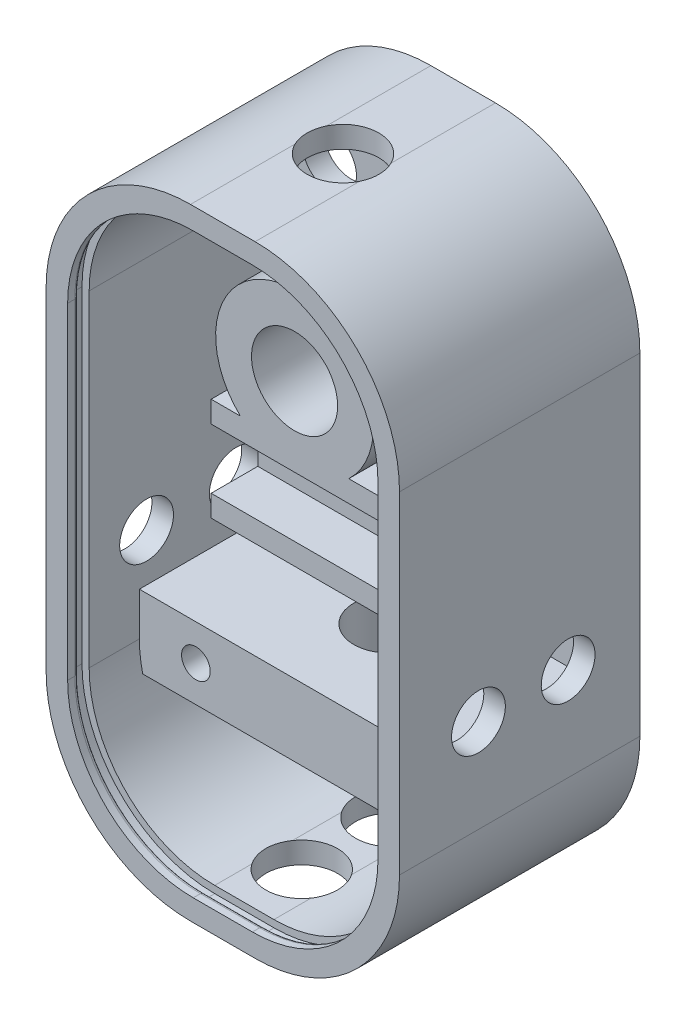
from build123d import *

# Parameters (mm, degrees)
SKIZZE2_W                            = 19.7
SKIZZE2_H                            = 34.6
SKIZZE2_W_2                          = 17.3
SKIZZE2_H_2                          = 32.2
LINEAR_AUSTRAGEN_D_NN1_DEPTH         = 13.4
VERRUNDUNG1_R                        = 7
VERRUNDUNG2_R                        = 8.05
AUFSATZ_LINEAR_START                 = -1.2
AUFSATZ_LINEAR_AUSTRAGEN2_DEPTH      = 1.2
SKIZZE6_R                            = 2
SCHNITT_LINEAR_AUSTRAGEN2_DEPTH      = 2
SKIZZE7_W                            = 18.44
SKIZZE7_H                            = 5.74
SKIZZE7_W_2                          = 16.04
SKIZZE7_H_2                          = 3.34
LINEAR_AUSTRAGEN_D_NN2_DEPTH         = 8.2
SKIZZE8_W                            = 16.04
SKIZZE8_H                            = 3.34
AUFSATZ_LINEAR_AUSTRAGEN3_DEPTH      = 5.6
SKIZZE10_W                           = 13.935
SKIZZE10_H                           = 1.235
SCHNITT_LINEAR_AUSTRAGEN3_DEPTH      = 15.5
SKIZZE11_W                           = 13.935
SKIZZE11_H                           = 1.235
AUFSATZ_LINEAR_AUSTRAGEN4_DEPTH      = 1.2
SKIZZE13_W                           = 17.3
SKIZZE13_H                           = 4
AUFSATZ_LINEAR_AUSTRAGEN6_DEPTH      = 8.2
SKIZZE14_R                           = 0.8
SCHNITT_LINEAR_AUSTRAGEN4_DEPTH      = 8.2
SKIZZE19_R                           = 1.5
SCHNITT_LINEAR_AUSTRAGEN5_DEPTH      = 25.4
SKIZZE20_R                           = 2
SCHNITT_LINEAR_AUSTRAGEN6_DEPTH      = 5.4
SKIZZE21_R                           = 1.5
SCHNITT_LINEAR_AUSTRAGEN7_DEPTH      = 5.4
SKIZZE22_R                           = 1.5
SCHNITT_LINEAR_AUSTRAGEN8_DEPTH      = 5.4
SKIZZE24_R                           = 4.4
SKIZZE24_R_2                         = 2.4
LINEAR_AUSTRAGEN_D_NN3_DEPTH         = 8.2
SKIZZE25_R                           = 2
SCHNITT_LINEAR_AUSTRAGEN9_DEPTH      = 4
VERRUNDUNG3_R                        = 0.6
VERRUNDUNG4_R                        = 0.6
VERRUNDUNG5_R                        = 0.6
SCHNITT_LINEAR_AUSTRAGEN_D_NN1_DEPTH = 1.2
LINEAR_AUSTRAGEN_D_NN4_DEPTH         = 0.6
VERRUNDUNG6_R                        = 0.2
SCHNITT_LINEAR_AUSTRAGEN12_DEPTH     = 6


with BuildPart() as part:
    # Skizze2 → Linear-Austragen-D_nn1 (new body)
    with BuildSketch(Plane.XY):
        with Locations((0, 4.05)):
            Rectangle(SKIZZE2_W, SKIZZE2_H)
        with Locations((0, 4.05)):
            Rectangle(SKIZZE2_W_2, SKIZZE2_H_2, mode=Mode.SUBTRACT)
    extrude(amount=LINEAR_AUSTRAGEN_D_NN1_DEPTH)

    # Verrundung1
    verrundung1_edges = [part.edges().sort_by_distance(p)[0] for p in [
        (-8.65, 20.15, 6.7),
        (-8.65, -12.05, 6.7),
        (8.65, -12.05, 6.7),
        (8.65, 20.15, 6.7),
    ]]
    fillet(verrundung1_edges, radius=VERRUNDUNG1_R)

    # Verrundung2
    verrundung2_edges = [part.edges().sort_by_distance(p)[0] for p in [
        (-9.85, 21.35, 6.7),
        (9.85, 21.35, 6.7),
        (9.85, -13.25, 6.7),
        (-9.85, -13.25, 6.7),
    ]]
    fillet(verrundung2_edges, radius=VERRUNDUNG2_R)

    # Skizze4 → Aufsatz-Linear austragen2 (add)
    with BuildSketch(Plane(origin=(0, 0, 0), x_dir=(-1, 0, 0), z_dir=(0, 0, -1)).offset(AUFSATZ_LINEAR_START)):
        with BuildLine():
            Line((1.65, -12.05), (-1.65, -12.05))
            ThreePointArc((-1.65, -12.05), (-6.599747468, -9.999747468), (-8.65, -5.05))
            Line((-8.65, -5.05), (-8.65, 13.15))
            ThreePointArc((-8.65, 13.15), (-6.599747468, 18.099747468), (-1.65, 20.15))
            Line((-1.65, 20.15), (1.65, 20.15))
            ThreePointArc((1.65, 20.15), (6.599747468, 18.099747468), (8.65, 13.15))
            Line((8.65, 13.15), (8.65, -5.05))
            ThreePointArc((8.65, -5.05), (6.599747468, -9.999747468), (1.65, -12.05))
        make_face()
    extrude(amount=AUFSATZ_LINEAR_AUSTRAGEN2_DEPTH)

    # Skizze6 → Schnitt-Linear austragen2 (cut)
    with BuildSketch(Plane(origin=(0, 21.35, 0), x_dir=(1, 0, 0), z_dir=(0, 1, 0))):
        with Locations(Location((0, -6.7, 0), (0, 0, 214.41150867))):
            Circle(SKIZZE6_R)
    extrude(amount=-SCHNITT_LINEAR_AUSTRAGEN2_DEPTH, mode=Mode.SUBTRACT)

    # Skizze7 → Linear-Austragen-D_nn2 (add)
    with BuildSketch(Plane.XY.offset(1.2)):
        with Locations((0, 5.65)):
            Rectangle(SKIZZE7_W, SKIZZE7_H)
        with Locations((0, 5.65)):
            Rectangle(SKIZZE7_W_2, SKIZZE7_H_2, mode=Mode.SUBTRACT)
    extrude(amount=LINEAR_AUSTRAGEN_D_NN2_DEPTH)

    # Skizze8 → Aufsatz-Linear austragen3 (add)
    with BuildSketch(Plane.XY.offset(1.2)):
        with Locations((0, 5.65)):
            Rectangle(SKIZZE8_W, SKIZZE8_H)
    extrude(amount=AUFSATZ_LINEAR_AUSTRAGEN3_DEPTH)

    # Skizze10 → Schnitt-Linear austragen3 (cut)
    with BuildSketch(Plane.XY):
        with Locations((0, 5.65)):
            Rectangle(SKIZZE10_W, SKIZZE10_H)
    extrude(amount=SCHNITT_LINEAR_AUSTRAGEN3_DEPTH, mode=Mode.SUBTRACT)

    # Skizze11 → Aufsatz-Linear austragen4 (add)
    with BuildSketch(Plane(origin=(0, 0, 0), x_dir=(-1, 0, 0), z_dir=(0, 0, -1))):
        with Locations((0, 5.65)):
            Rectangle(SKIZZE11_W, SKIZZE11_H)
    extrude(amount=-AUFSATZ_LINEAR_AUSTRAGEN4_DEPTH)

    # Skizze13 → Aufsatz-Linear austragen6 (add)
    with BuildSketch(Plane.XY.offset(1.2)):
        with Locations((0, -4.65)):
            Rectangle(SKIZZE13_W, SKIZZE13_H)
    extrude(amount=AUFSATZ_LINEAR_AUSTRAGEN6_DEPTH)

    # Skizze14 → Schnitt-Linear austragen4 (cut)
    with BuildSketch(Plane.XY.offset(9.4)):
        with Locations((-5.5, -4.65)):
            Circle(SKIZZE14_R)
        with Locations((5.5, -4.65)):
            Circle(SKIZZE14_R)
    extrude(amount=-SCHNITT_LINEAR_AUSTRAGEN4_DEPTH, mode=Mode.SUBTRACT)

    # Skizze19 → Schnitt-Linear austragen5 (cut)
    with BuildSketch(Plane(origin=(9.85, 0, 0), x_dir=(0, 0, -1), z_dir=(1, 0, 0))):
        with Locations(Location((-4, 0, 0), (0, 0, 90))):
            Circle(SKIZZE19_R)
        with Locations(Location((-9, 0, 0), (0, 0, 90))):
            Circle(SKIZZE19_R)
    extrude(amount=-SCHNITT_LINEAR_AUSTRAGEN5_DEPTH, mode=Mode.SUBTRACT)

    # Skizze20 → Schnitt-Linear austragen6 (cut)
    with BuildSketch(Plane.XZ.offset(13.25)):
        with Locations(Location((0, 4, 0), (0, 0, 214.41150867))):
            Circle(SKIZZE20_R)
        with Locations(Location((0, 9, 0), (0, 0, 214.41150867))):
            Circle(SKIZZE20_R)
    extrude(amount=-SCHNITT_LINEAR_AUSTRAGEN6_DEPTH, mode=Mode.SUBTRACT)

    # Skizze21 → Schnitt-Linear austragen7 (cut)
    with BuildSketch(Plane.XY.offset(1.2)):
        with Locations((-3.65, 0.18)):
            Circle(SKIZZE21_R)
        with Locations((3.65, 0.18)):
            Circle(SKIZZE21_R)
        with Locations((3.65, -9.05)):
            Circle(SKIZZE21_R)
        with Locations((-3.65, -9.05)):
            Circle(SKIZZE21_R)
    extrude(amount=-SCHNITT_LINEAR_AUSTRAGEN7_DEPTH, mode=Mode.SUBTRACT)

    # Skizze22 → Schnitt-Linear austragen8 (cut)
    with BuildSketch(Plane.XY.offset(1.2)):
        with Locations((-6.25, 15.15)):
            Circle(SKIZZE22_R)
        with Locations((6.25, 15.15)):
            Circle(SKIZZE22_R)
    extrude(amount=-SCHNITT_LINEAR_AUSTRAGEN8_DEPTH, mode=Mode.SUBTRACT)

    # Skizze24 → Linear-Austragen-D_nn3 (add)
    with BuildSketch(Plane.XY.offset(1.2)):
        with Locations((0, 11.72)):
            Circle(SKIZZE24_R)
        with Locations((0, 11.72)):
            Circle(SKIZZE24_R_2, mode=Mode.SUBTRACT)
    extrude(amount=LINEAR_AUSTRAGEN_D_NN3_DEPTH)

    # Skizze25 → Schnitt-Linear austragen9 (cut)
    with BuildSketch(Plane.XZ.offset(6.65)):
        with Locations((0, 4.1)):
            Circle(SKIZZE25_R)
    extrude(amount=-SCHNITT_LINEAR_AUSTRAGEN9_DEPTH, mode=Mode.SUBTRACT)

    # Verrundung3
    verrundung3_edges = [part.edges().sort_by_distance(p)[0] for p in [
        (-8.65, 10.835, 1.2),
        (8.65, 10.835, 1.2),
        (6.599747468, 18.099747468, 1.2),
        (0, 20.15, 1.2),
        (-6.599747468, 18.099747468, 1.2),
    ]]
    fillet(verrundung3_edges, radius=VERRUNDUNG3_R)

    # Verrundung4
    verrundung4_edges = [part.edges().sort_by_distance(p)[0] for p in [
        (8.65, 0.065, 1.2),
        (-8.65, 0.065, 1.2),
    ]]
    fillet(verrundung4_edges, radius=VERRUNDUNG4_R)

    # Verrundung5
    verrundung5_edges = [part.edges().sort_by_distance(p)[0] for p in [
        (5.997413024, -10.53634669, 1.2),
        (-5.997413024, -10.53634669, 1.2),
        (0, -12.05, 1.2),
    ]]
    fillet(verrundung5_edges, radius=VERRUNDUNG5_R)

    # Skizze28 → Schnitt-Linear-Austragen-D_nn1 (cut)
    with BuildSketch(Plane.XY.offset(13.4)):
        with BuildLine():
            Line((-9.05, 13.15), (-9.05, -5.05))
            ThreePointArc((-9.05, -5.05), (-6.882590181, -10.282590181), (-1.65, -12.45))
            Line((-1.65, -12.45), (1.65, -12.45))
            ThreePointArc((1.65, -12.45), (6.882590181, -10.282590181), (9.05, -5.05))
            Line((9.05, -5.05), (9.05, 13.15))
            ThreePointArc((9.05, 13.15), (6.882590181, 18.382590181), (1.65, 20.55))
            Line((1.65, 20.55), (-1.65, 20.55))
            ThreePointArc((-1.65, 20.55), (-6.882590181, 18.382590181), (-9.05, 13.15))
        make_face()
        with BuildLine():
            Line((-8.65, 13.15), (-8.65, -5.05))
            ThreePointArc((-8.65, -5.05), (-6.599747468, -9.999747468), (-1.65, -12.05))
            Line((-1.65, -12.05), (1.65, -12.05))
            ThreePointArc((1.65, -12.05), (6.599747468, -9.999747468), (8.65, -5.05))
            Line((8.65, -5.05), (8.65, 13.15))
            ThreePointArc((8.65, 13.15), (6.599747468, 18.099747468), (1.65, 20.15))
            Line((1.65, 20.15), (-1.65, 20.15))
            ThreePointArc((-1.65, 20.15), (-6.599747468, 18.099747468), (-8.65, 13.15))
        make_face(mode=Mode.SUBTRACT)
    extrude(amount=-SCHNITT_LINEAR_AUSTRAGEN_D_NN1_DEPTH, mode=Mode.SUBTRACT)

    # Skizze31 → Linear-Austragen-D_nn4 (add)
    with BuildSketch(Plane.XY.offset(13.4)):
        with BuildLine():
            Line((-9.05, 13.15), (-9.05, -5.05))
            ThreePointArc((-9.05, -5.05), (-6.882590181, -10.282590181), (-1.65, -12.45))
            Line((-1.65, -12.45), (1.65, -12.45))
            ThreePointArc((1.65, -12.45), (6.882590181, -10.282590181), (9.05, -5.05))
            Line((9.05, -5.05), (9.05, 13.15))
            ThreePointArc((9.05, 13.15), (6.882590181, 18.382590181), (1.65, 20.55))
            Line((1.65, 20.55), (-1.65, 20.55))
            ThreePointArc((-1.65, 20.55), (-6.882590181, 18.382590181), (-9.05, 13.15))
        make_face()
        with BuildLine():
            Line((-8.65, 13.15), (-8.65, -5.05))
            ThreePointArc((-8.65, -5.05), (-6.599747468, -9.999747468), (-1.65, -12.05))
            Line((-1.65, -12.05), (1.65, -12.05))
            ThreePointArc((1.65, -12.05), (6.599747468, -9.999747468), (8.65, -5.05))
            Line((8.65, -5.05), (8.65, 13.15))
            ThreePointArc((8.65, 13.15), (6.599747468, 18.099747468), (1.65, 20.15))
            Line((1.65, 20.15), (-1.65, 20.15))
            ThreePointArc((-1.65, 20.15), (-6.599747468, 18.099747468), (-8.65, 13.15))
        make_face(mode=Mode.SUBTRACT)
    extrude(amount=-LINEAR_AUSTRAGEN_D_NN4_DEPTH)

    # Verrundung6
    verrundung6_edges = [part.edges().sort_by_distance(p)[0] for p in [
        (-8.65, 4.05, 12.8),
        (-6.599747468, -9.999747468, 12.8),
        (0, -12.05, 12.8),
        (6.599747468, -9.999747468, 12.8),
        (8.65, 4.05, 12.8),
        (6.599747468, 18.099747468, 12.8),
        (0, 20.15, 12.8),
        (-6.599747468, 18.099747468, 12.8),
    ]]
    fillet(verrundung6_edges, radius=VERRUNDUNG6_R)

    # Skizze26 → Schnitt-Linear austragen12 (cut)
    with BuildSketch(Plane.XZ.offset(-2.78)):
        with BuildLine():
            ThreePointArc((-8.65, 3.2), (-6.65, 5.2), (-4.65, 3.2))
            Line((-4.65, 3.2), (-4.65, 9.4))
            Line((-4.65, 9.4), (-8.65, 9.4))
            Line((-8.65, 9.4), (-8.65, 3.2))
        make_face()
        with BuildLine():
            ThreePointArc((-8.65, 3.2), (-6.65, 1.2), (-4.65, 3.2))
            Line((-4.65, 3.2), (-8.65, 3.2))
        make_face()
        with BuildLine():
            Line((-8.65, 3.2), (-4.65, 3.2))
            ThreePointArc((-4.65, 3.2), (-6.65, 5.2), (-8.65, 3.2))
        make_face()
        with BuildLine():
            ThreePointArc((-8.65, 3.2), (-6.65, 1.2), (-4.65, 3.2))
            Line((-4.65, 3.2), (-8.65, 3.2))
        make_face()
        with BuildLine():
            Line((-8.65, 3.2), (-4.65, 3.2))
            ThreePointArc((-4.65, 3.2), (-6.65, 5.2), (-8.65, 3.2))
        make_face()
    extrude(amount=-SCHNITT_LINEAR_AUSTRAGEN12_DEPTH, mode=Mode.SUBTRACT)


solid = part.part
